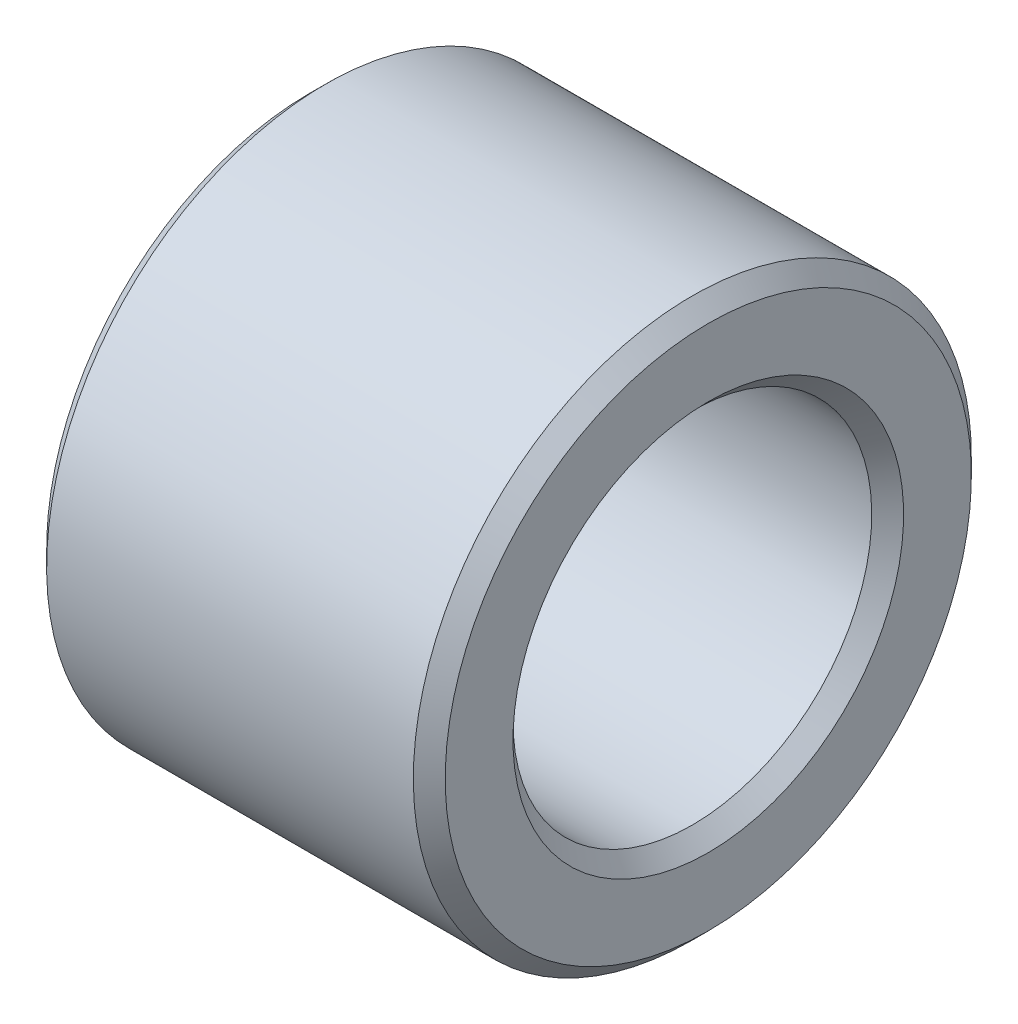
ISO-10303-21;
HEADER;
FILE_DESCRIPTION(('STEP AP214'),'2;1');
FILE_NAME('part.step','',(''),(''),'','','');
FILE_SCHEMA(('AUTOMOTIVE_DESIGN { 1 0 10303 214 1 1 1 1 }'));
ENDSEC;
DATA;
#1=APPLICATION_CONTEXT('core data for automotive mechanical design processes');
#2=APPLICATION_PROTOCOL_DEFINITION('international standard','automotive_design',2000,#1);
#3=PRODUCT_CONTEXT('',#1,'mechanical');
#4=PRODUCT('Part','Part','',(#3));
#5=PRODUCT_RELATED_PRODUCT_CATEGORY('part','',(#4));
#6=PRODUCT_DEFINITION_FORMATION('','',#4);
#7=PRODUCT_DEFINITION_CONTEXT('part definition',#1,'design');
#8=PRODUCT_DEFINITION('design','',#6,#7);
#9=PRODUCT_DEFINITION_SHAPE('','',#8);
#10=(LENGTH_UNIT() NAMED_UNIT(*) SI_UNIT(.MILLI.,.METRE.));
#11=(NAMED_UNIT(*) PLANE_ANGLE_UNIT() SI_UNIT($,.RADIAN.));
#12=(NAMED_UNIT(*) SI_UNIT($,.STERADIAN.) SOLID_ANGLE_UNIT());
#13=UNCERTAINTY_MEASURE_WITH_UNIT(LENGTH_MEASURE(1.E-05),#10,'distance_accuracy_value','');
#14=(GEOMETRIC_REPRESENTATION_CONTEXT(3) GLOBAL_UNCERTAINTY_ASSIGNED_CONTEXT((#13)) GLOBAL_UNIT_ASSIGNED_CONTEXT((#10,
#11,#12)) REPRESENTATION_CONTEXT('',''));
#15=CARTESIAN_POINT('',(0.,0.,0.));
#16=DIRECTION('',(0.,0.,1.));
#17=DIRECTION('',(1.,0.,0.));
#18=AXIS2_PLACEMENT_3D('',#15,#16,#17);
#19=CARTESIAN_POINT('',(0.,-5.75,0.));
#20=DIRECTION('',(-1.,0.,0.));
#21=DIRECTION('',(0.,1.,0.));
#22=AXIS2_PLACEMENT_3D('',#19,#20,#21);
#23=PLANE('',#22);
#24=CARTESIAN_POINT('',(0.,0.,0.));
#25=DIRECTION('',(1.,0.,0.));
#26=DIRECTION('',(0.,-1.,0.));
#27=AXIS2_PLACEMENT_3D('',#24,#25,#26);
#28=CIRCLE('',#27,4.9);
#29=CARTESIAN_POINT('',(0.,-4.9,0.));
#30=VERTEX_POINT('',#29);
#31=EDGE_CURVE('E10',#30,#30,#28,.T.);
#32=ORIENTED_EDGE('',*,*,#31,.T.);
#33=EDGE_LOOP('',(#32));
#34=FACE_BOUND('',#33,.T.);
#35=CARTESIAN_POINT('',(0.,0.,0.));
#36=DIRECTION('',(1.,0.,0.));
#37=DIRECTION('',(0.,-1.,0.));
#38=AXIS2_PLACEMENT_3D('',#35,#36,#37);
#39=CIRCLE('',#38,6.6);
#40=CARTESIAN_POINT('',(0.,-6.6,0.));
#41=VERTEX_POINT('',#40);
#42=EDGE_CURVE('E54',#41,#41,#39,.T.);
#43=ORIENTED_EDGE('',*,*,#42,.F.);
#44=EDGE_LOOP('',(#43));
#45=FACE_BOUND('',#44,.T.);
#46=ADVANCED_FACE('F16',(#34,#45),#23,.T.);
#47=CARTESIAN_POINT('',(0.2,0.,0.));
#48=DIRECTION('',(-1.,0.,0.));
#49=DIRECTION('',(0.,-1.,0.));
#50=AXIS2_PLACEMENT_3D('',#47,#48,#49);
#51=CONICAL_SURFACE('',#50,4.7,0.785398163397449);
#52=CARTESIAN_POINT('',(0.4,0.,0.));
#53=DIRECTION('',(1.,0.,0.));
#54=DIRECTION('',(0.,-1.,0.));
#55=AXIS2_PLACEMENT_3D('',#52,#53,#54);
#56=CIRCLE('',#55,4.5);
#57=CARTESIAN_POINT('',(0.4,-4.5,0.));
#58=VERTEX_POINT('',#57);
#59=EDGE_CURVE('E23',#58,#58,#56,.T.);
#60=ORIENTED_EDGE('',*,*,#59,.T.);
#61=EDGE_LOOP('',(#60));
#62=FACE_BOUND('',#61,.T.);
#63=ORIENTED_EDGE('',*,*,#31,.F.);
#64=EDGE_LOOP('',(#63));
#65=FACE_BOUND('',#64,.T.);
#66=ADVANCED_FACE('F83',(#62,#65),#51,.F.);
#67=CARTESIAN_POINT('',(5.,0.,0.));
#68=DIRECTION('',(-1.,0.,0.));
#69=DIRECTION('',(0.,-1.,0.));
#70=AXIS2_PLACEMENT_3D('',#67,#68,#69);
#71=CYLINDRICAL_SURFACE('',#70,4.5);
#72=CARTESIAN_POINT('',(9.6,0.,0.));
#73=DIRECTION('',(1.,0.,0.));
#74=DIRECTION('',(0.,-1.,0.));
#75=AXIS2_PLACEMENT_3D('',#72,#73,#74);
#76=CIRCLE('',#75,4.5);
#77=CARTESIAN_POINT('',(9.6,-4.5,0.));
#78=VERTEX_POINT('',#77);
#79=EDGE_CURVE('E59',#78,#78,#76,.T.);
#80=ORIENTED_EDGE('',*,*,#79,.T.);
#81=EDGE_LOOP('',(#80));
#82=FACE_BOUND('',#81,.T.);
#83=ORIENTED_EDGE('',*,*,#59,.F.);
#84=EDGE_LOOP('',(#83));
#85=FACE_BOUND('',#84,.T.);
#86=ADVANCED_FACE('F67',(#82,#85),#71,.F.);
#87=CARTESIAN_POINT('',(9.8,0.,0.));
#88=DIRECTION('',(1.,0.,0.));
#89=DIRECTION('',(0.,-1.,0.));
#90=AXIS2_PLACEMENT_3D('',#87,#88,#89);
#91=CONICAL_SURFACE('',#90,4.7,0.785398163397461);
#92=CARTESIAN_POINT('',(10.,0.,0.));
#93=DIRECTION('',(1.,0.,0.));
#94=DIRECTION('',(0.,-1.,0.));
#95=AXIS2_PLACEMENT_3D('',#92,#93,#94);
#96=CIRCLE('',#95,4.9);
#97=CARTESIAN_POINT('',(10.,-4.9,0.));
#98=VERTEX_POINT('',#97);
#99=EDGE_CURVE('E64',#98,#98,#96,.T.);
#100=ORIENTED_EDGE('',*,*,#99,.T.);
#101=EDGE_LOOP('',(#100));
#102=FACE_BOUND('',#101,.T.);
#103=ORIENTED_EDGE('',*,*,#79,.F.);
#104=EDGE_LOOP('',(#103));
#105=FACE_BOUND('',#104,.T.);
#106=ADVANCED_FACE('F70',(#102,#105),#91,.F.);
#107=CARTESIAN_POINT('',(10.,-5.75,0.));
#108=DIRECTION('',(1.,0.,0.));
#109=DIRECTION('',(0.,-1.,0.));
#110=AXIS2_PLACEMENT_3D('',#107,#108,#109);
#111=PLANE('',#110);
#112=CARTESIAN_POINT('',(10.,0.,0.));
#113=DIRECTION('',(1.,0.,0.));
#114=DIRECTION('',(0.,-1.,0.));
#115=AXIS2_PLACEMENT_3D('',#112,#113,#114);
#116=CIRCLE('',#115,6.6);
#117=CARTESIAN_POINT('',(10.,-6.6,0.));
#118=VERTEX_POINT('',#117);
#119=EDGE_CURVE('E62',#118,#118,#116,.T.);
#120=ORIENTED_EDGE('',*,*,#119,.T.);
#121=EDGE_LOOP('',(#120));
#122=FACE_BOUND('',#121,.T.);
#123=ORIENTED_EDGE('',*,*,#99,.F.);
#124=EDGE_LOOP('',(#123));
#125=FACE_BOUND('',#124,.T.);
#126=ADVANCED_FACE('F72',(#122,#125),#111,.T.);
#127=CARTESIAN_POINT('',(9.8,0.,0.));
#128=DIRECTION('',(-1.,0.,0.));
#129=DIRECTION('',(0.,-1.,0.));
#130=AXIS2_PLACEMENT_3D('',#127,#128,#129);
#131=CONICAL_SURFACE('',#130,6.8,0.785398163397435);
#132=CARTESIAN_POINT('',(9.6,0.,0.));
#133=DIRECTION('',(1.,0.,0.));
#134=DIRECTION('',(0.,-1.,0.));
#135=AXIS2_PLACEMENT_3D('',#132,#133,#134);
#136=CIRCLE('',#135,7.);
#137=CARTESIAN_POINT('',(9.6,-7.,0.));
#138=VERTEX_POINT('',#137);
#139=EDGE_CURVE('E56',#138,#138,#136,.T.);
#140=ORIENTED_EDGE('',*,*,#139,.T.);
#141=EDGE_LOOP('',(#140));
#142=FACE_BOUND('',#141,.T.);
#143=ORIENTED_EDGE('',*,*,#119,.F.);
#144=EDGE_LOOP('',(#143));
#145=FACE_BOUND('',#144,.T.);
#146=ADVANCED_FACE('F80',(#142,#145),#131,.T.);
#147=CARTESIAN_POINT('',(5.,0.,0.));
#148=DIRECTION('',(-1.,0.,0.));
#149=DIRECTION('',(0.,-1.,0.));
#150=AXIS2_PLACEMENT_3D('',#147,#148,#149);
#151=CYLINDRICAL_SURFACE('',#150,7.);
#152=CARTESIAN_POINT('',(0.4,0.,0.));
#153=DIRECTION('',(1.,0.,0.));
#154=DIRECTION('',(0.,-1.,0.));
#155=AXIS2_PLACEMENT_3D('',#152,#153,#154);
#156=CIRCLE('',#155,7.);
#157=CARTESIAN_POINT('',(0.4,-7.,0.));
#158=VERTEX_POINT('',#157);
#159=EDGE_CURVE('E50',#158,#158,#156,.T.);
#160=ORIENTED_EDGE('',*,*,#159,.T.);
#161=EDGE_LOOP('',(#160));
#162=FACE_BOUND('',#161,.T.);
#163=ORIENTED_EDGE('',*,*,#139,.F.);
#164=EDGE_LOOP('',(#163));
#165=FACE_BOUND('',#164,.T.);
#166=ADVANCED_FACE('F51',(#162,#165),#151,.T.);
#167=CARTESIAN_POINT('',(0.2,0.,0.));
#168=DIRECTION('',(1.,0.,0.));
#169=DIRECTION('',(0.,-1.,0.));
#170=AXIS2_PLACEMENT_3D('',#167,#168,#169);
#171=CONICAL_SURFACE('',#170,6.8,0.785398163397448);
#172=ORIENTED_EDGE('',*,*,#42,.T.);
#173=EDGE_LOOP('',(#172));
#174=FACE_BOUND('',#173,.T.);
#175=ORIENTED_EDGE('',*,*,#159,.F.);
#176=EDGE_LOOP('',(#175));
#177=FACE_BOUND('',#176,.T.);
#178=ADVANCED_FACE('F93',(#174,#177),#171,.T.);
#179=CLOSED_SHELL('',(#46,#66,#86,#106,#126,#146,#166,#178));
#180=MANIFOLD_SOLID_BREP('B1',#179);
#181=ADVANCED_BREP_SHAPE_REPRESENTATION('',(#18,#180),#14);
#182=SHAPE_DEFINITION_REPRESENTATION(#9,#181);
ENDSEC;
END-ISO-10303-21;
